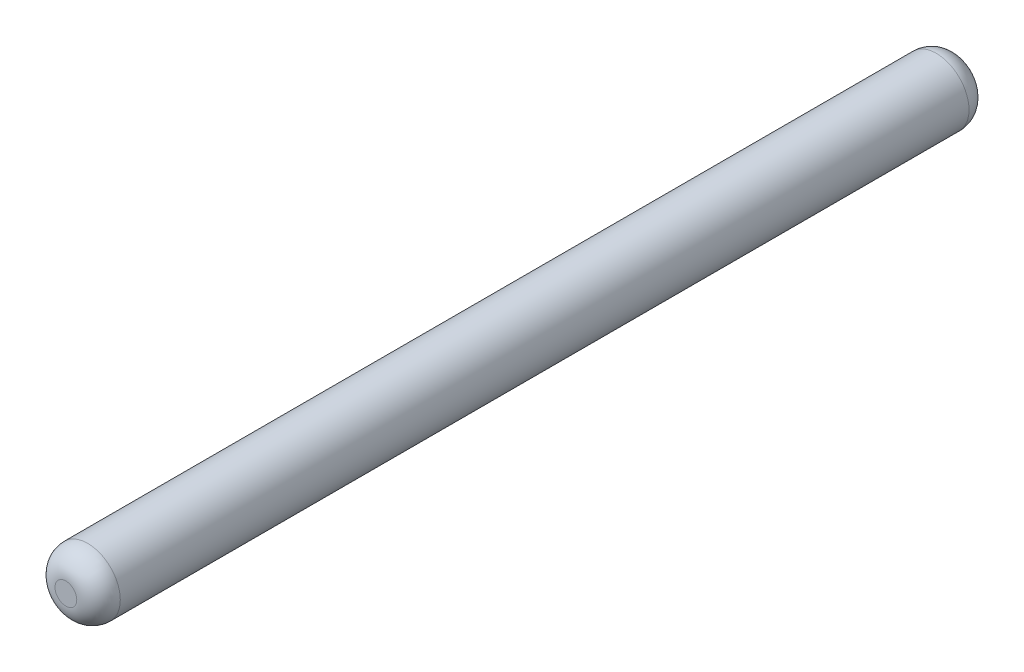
ISO-10303-21;
HEADER;
FILE_DESCRIPTION(('STEP AP214'),'2;1');
FILE_NAME('part.step','',(''),(''),'','','');
FILE_SCHEMA(('AUTOMOTIVE_DESIGN { 1 0 10303 214 1 1 1 1 }'));
ENDSEC;
DATA;
#1=APPLICATION_CONTEXT('core data for automotive mechanical design processes');
#2=APPLICATION_PROTOCOL_DEFINITION('international standard','automotive_design',2000,#1);
#3=PRODUCT_CONTEXT('',#1,'mechanical');
#4=PRODUCT('Part','Part','',(#3));
#5=PRODUCT_RELATED_PRODUCT_CATEGORY('part','',(#4));
#6=PRODUCT_DEFINITION_FORMATION('','',#4);
#7=PRODUCT_DEFINITION_CONTEXT('part definition',#1,'design');
#8=PRODUCT_DEFINITION('design','',#6,#7);
#9=PRODUCT_DEFINITION_SHAPE('','',#8);
#10=(LENGTH_UNIT() NAMED_UNIT(*) SI_UNIT(.MILLI.,.METRE.));
#11=(NAMED_UNIT(*) PLANE_ANGLE_UNIT() SI_UNIT($,.RADIAN.));
#12=(NAMED_UNIT(*) SI_UNIT($,.STERADIAN.) SOLID_ANGLE_UNIT());
#13=UNCERTAINTY_MEASURE_WITH_UNIT(LENGTH_MEASURE(1.E-05),#10,'distance_accuracy_value','');
#14=(GEOMETRIC_REPRESENTATION_CONTEXT(3) GLOBAL_UNCERTAINTY_ASSIGNED_CONTEXT((#13)) GLOBAL_UNIT_ASSIGNED_CONTEXT((#10,
#11,#12)) REPRESENTATION_CONTEXT('',''));
#15=CARTESIAN_POINT('',(0.,0.,0.));
#16=DIRECTION('',(0.,0.,1.));
#17=DIRECTION('',(1.,0.,0.));
#18=AXIS2_PLACEMENT_3D('',#15,#16,#17);
#19=CARTESIAN_POINT('',(0.,0.,82.));
#20=DIRECTION('',(0.,0.,-1.));
#21=DIRECTION('',(-1.,0.,0.));
#22=AXIS2_PLACEMENT_3D('',#19,#20,#21);
#23=PLANE('',#22);
#24=CARTESIAN_POINT('',(1.,0.,82.));
#25=CARTESIAN_POINT('',(0.999981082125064,-0.0183386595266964,81.9999999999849));
#26=CARTESIAN_POINT('',(0.999459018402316,-0.0366766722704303,81.9999999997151));
#27=CARTESIAN_POINT('',(0.997433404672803,-0.0729278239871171,81.9999999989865));
#28=CARTESIAN_POINT('',(0.995949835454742,-0.0908420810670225,81.9999999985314));
#29=CARTESIAN_POINT('',(0.992064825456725,-0.12619835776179,81.9999999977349));
#30=CARTESIAN_POINT('',(0.989682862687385,-0.143642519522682,81.9999999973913));
#31=CARTESIAN_POINT('',(0.984066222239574,-0.17801775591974,81.9999999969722));
#32=CARTESIAN_POINT('',(0.980850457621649,-0.194951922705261,81.9999999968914));
#33=CARTESIAN_POINT('',(0.973631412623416,-0.228272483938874,81.9999999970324));
#34=CARTESIAN_POINT('',(0.96964644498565,-0.244662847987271,81.9999999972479));
#35=CARTESIAN_POINT('',(0.960953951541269,-0.276867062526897,81.9999999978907));
#36=CARTESIAN_POINT('',(0.956264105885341,-0.292685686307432,81.9999999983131));
#37=CARTESIAN_POINT('',(0.946226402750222,-0.3237231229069,81.9999999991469));
#38=CARTESIAN_POINT('',(0.940895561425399,-0.338947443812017,81.9999999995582));
#39=CARTESIAN_POINT('',(0.929638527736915,-0.368778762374,82.0000000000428));
#40=CARTESIAN_POINT('',(0.923728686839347,-0.383391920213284,82.0000000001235));
#41=CARTESIAN_POINT('',(0.913975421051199,-0.405973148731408,81.9999999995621));
#42=CARTESIAN_POINT('',(0.910363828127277,-0.414042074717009,81.9999999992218));
#43=CARTESIAN_POINT('',(0.903376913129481,-0.429112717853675,81.9999999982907));
#44=CARTESIAN_POINT('',(0.900025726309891,-0.436125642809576,81.9999999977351));
#45=CARTESIAN_POINT('',(0.88858060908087,-0.459367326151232,81.9999999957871));
#46=CARTESIAN_POINT('',(0.880120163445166,-0.475417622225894,81.9999999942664));
#47=CARTESIAN_POINT('',(0.862330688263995,-0.507028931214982,81.9999999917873));
#48=CARTESIAN_POINT('',(0.853001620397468,-0.522589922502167,81.9999999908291));
#49=CARTESIAN_POINT('',(0.833502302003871,-0.553176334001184,81.999999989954));
#50=CARTESIAN_POINT('',(0.823332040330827,-0.568201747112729,81.9999999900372));
#51=CARTESIAN_POINT('',(0.802181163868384,-0.597670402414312,81.9999999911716));
#52=CARTESIAN_POINT('',(0.791200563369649,-0.612113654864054,81.9999999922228));
#53=CARTESIAN_POINT('',(0.76846430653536,-0.640375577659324,81.9999999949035));
#54=CARTESIAN_POINT('',(0.756708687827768,-0.654194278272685,81.9999999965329));
#55=CARTESIAN_POINT('',(0.732451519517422,-0.681159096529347,81.9999999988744));
#56=CARTESIAN_POINT('',(0.71995002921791,-0.694305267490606,81.9999999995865));
#57=CARTESIAN_POINT('',(0.694218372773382,-0.719953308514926,82.000000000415));
#58=CARTESIAN_POINT('',(0.680985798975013,-0.732452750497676,82.0000000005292));
#59=CARTESIAN_POINT('',(0.651985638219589,-0.758527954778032,81.9999999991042));
#60=CARTESIAN_POINT('',(0.636126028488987,-0.772002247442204,81.9999999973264));
#61=CARTESIAN_POINT('',(0.612000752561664,-0.791168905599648,81.9999999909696));
#62=CARTESIAN_POINT('',(0.604060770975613,-0.797274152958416,81.9999999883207));
#63=CARTESIAN_POINT('',(0.579285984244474,-0.815702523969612,81.9999999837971));
#64=CARTESIAN_POINT('',(0.56212988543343,-0.827599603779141,81.9999999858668));
#65=CARTESIAN_POINT('',(0.538098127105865,-0.843175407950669,81.9999999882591));
#66=CARTESIAN_POINT('',(0.531523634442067,-0.847328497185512,81.9999999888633));
#67=CARTESIAN_POINT('',(0.515446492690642,-0.857222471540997,81.9999999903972));
#68=CARTESIAN_POINT('',(0.505893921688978,-0.86288289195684,81.9999999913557));
#69=CARTESIAN_POINT('',(0.487352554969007,-0.873457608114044,81.9999999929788));
#70=CARTESIAN_POINT('',(0.47837730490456,-0.878395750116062,81.9999999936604));
#71=CARTESIAN_POINT('',(0.457934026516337,-0.889237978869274,81.999999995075));
#72=CARTESIAN_POINT('',(0.446422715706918,-0.895060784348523,81.9999999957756));
#73=CARTESIAN_POINT('',(0.424700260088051,-0.905526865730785,81.9999999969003));
#74=CARTESIAN_POINT('',(0.41451543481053,-0.91022491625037,81.9999999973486));
#75=CARTESIAN_POINT('',(0.395533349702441,-0.918597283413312,81.9999999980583));
#76=CARTESIAN_POINT('',(0.386757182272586,-0.922319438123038,81.9999999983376));
#77=CARTESIAN_POINT('',(0.370661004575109,-0.928877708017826,81.999999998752));
#78=CARTESIAN_POINT('',(0.363357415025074,-0.931754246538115,81.9999999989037));
#79=CARTESIAN_POINT('',(0.346065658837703,-0.93833021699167,81.9999999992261));
#80=CARTESIAN_POINT('',(0.336049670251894,-0.941956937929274,81.9999999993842));
#81=CARTESIAN_POINT('',(0.323084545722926,-0.946429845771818,81.9999999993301));
#82=CARTESIAN_POINT('',(0.320183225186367,-0.947416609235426,81.9999999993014));
#83=CARTESIAN_POINT('',(0.310475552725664,-0.950672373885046,81.9999999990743));
#84=CARTESIAN_POINT('',(0.303650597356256,-0.952886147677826,81.9999999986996));
#85=CARTESIAN_POINT('',(0.280822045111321,-0.960013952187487,81.9999999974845));
#86=CARTESIAN_POINT('',(0.264712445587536,-0.964593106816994,81.9999999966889));
#87=CARTESIAN_POINT('',(0.232283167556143,-0.972932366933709,81.9999999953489));
#88=CARTESIAN_POINT('',(0.215963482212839,-0.976692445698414,81.9999999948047));
#89=CARTESIAN_POINT('',(0.183153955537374,-0.983380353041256,81.9999999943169));
#90=CARTESIAN_POINT('',(0.166664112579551,-0.98630817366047,81.9999999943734));
#91=CARTESIAN_POINT('',(0.13355762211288,-0.991324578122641,81.999999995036));
#92=CARTESIAN_POINT('',(0.116940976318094,-0.993413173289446,81.9999999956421));
#93=CARTESIAN_POINT('',(0.0836237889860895,-0.996746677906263,81.9999999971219));
#94=CARTESIAN_POINT('',(0.0669232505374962,-0.99799161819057,81.9999999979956));
#95=CARTESIAN_POINT('',(0.0334815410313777,-0.999630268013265,81.9999999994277));
#96=CARTESIAN_POINT('',(0.0167403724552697,-1.00002402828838,81.9999999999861));
#97=CARTESIAN_POINT('',(-0.0167205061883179,-0.999976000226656,82.0000000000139));
#98=CARTESIAN_POINT('',(-0.0334402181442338,-0.999535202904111,81.9999999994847));
#99=CARTESIAN_POINT('',(-0.0668376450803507,-0.997837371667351,81.9999999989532));
#100=CARTESIAN_POINT('',(-0.0835153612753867,-0.996580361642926,81.9999999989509));
#101=CARTESIAN_POINT('',(-0.116789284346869,-0.993249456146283,81.9999999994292));
#102=CARTESIAN_POINT('',(-0.133385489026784,-0.991175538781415,81.9999999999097));
#103=CARTESIAN_POINT('',(-0.166458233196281,-0.986213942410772,82.0000000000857));
#104=CARTESIAN_POINT('',(-0.182934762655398,-0.983326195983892,81.9999999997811));
#105=CARTESIAN_POINT('',(-0.204014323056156,-0.979101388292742,81.9999999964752));
#106=CARTESIAN_POINT('',(-0.208692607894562,-0.978129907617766,81.9999999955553));
#107=CARTESIAN_POINT('',(-0.225051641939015,-0.974603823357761,81.9999999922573));
#108=CARTESIAN_POINT('',(-0.236692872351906,-0.971863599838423,81.9999999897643));
#109=CARTESIAN_POINT('',(-0.264496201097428,-0.964752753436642,81.9999999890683));
#110=CARTESIAN_POINT('',(-0.28060449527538,-0.960168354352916,81.9999999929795));
#111=CARTESIAN_POINT('',(-0.303410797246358,-0.952978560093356,81.999999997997));
#112=CARTESIAN_POINT('',(-0.310226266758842,-0.95073924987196,81.9999999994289));
#113=CARTESIAN_POINT('',(-0.321946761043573,-0.94677453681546,82.0000000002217));
#114=CARTESIAN_POINT('',(-0.32686137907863,-0.945077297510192,82.0000000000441));
#115=CARTESIAN_POINT('',(-0.348352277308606,-0.93748647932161,81.9999999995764));
#116=CARTESIAN_POINT('',(-0.364804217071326,-0.931232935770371,82.0000000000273));
#117=CARTESIAN_POINT('',(-0.39487161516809,-0.918887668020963,81.99999999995));
#118=CARTESIAN_POINT('',(-0.408536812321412,-0.912916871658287,81.9999999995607));
#119=CARTESIAN_POINT('',(-0.42911270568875,-0.903376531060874,81.9999999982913));
#120=CARTESIAN_POINT('',(-0.436125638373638,-0.900025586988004,81.9999999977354));
#121=CARTESIAN_POINT('',(-0.459367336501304,-0.888580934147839,81.9999999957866));
#122=CARTESIAN_POINT('',(-0.475417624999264,-0.880120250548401,81.9999999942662));
#123=CARTESIAN_POINT('',(-0.507028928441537,-0.862330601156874,81.9999999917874));
#124=CARTESIAN_POINT('',(-0.522589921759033,-0.853001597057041,81.9999999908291));
#125=CARTESIAN_POINT('',(-0.55317633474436,-0.83350232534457,81.999999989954));
#126=CARTESIAN_POINT('',(-0.56820174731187,-0.823332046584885,81.9999999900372));
#127=CARTESIAN_POINT('',(-0.597670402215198,-0.802181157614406,81.9999999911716));
#128=CARTESIAN_POINT('',(-0.612113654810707,-0.791200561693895,81.9999999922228));
#129=CARTESIAN_POINT('',(-0.640375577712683,-0.768464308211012,81.9999999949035));
#130=CARTESIAN_POINT('',(-0.65419427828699,-0.756708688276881,81.9999999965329));
#131=CARTESIAN_POINT('',(-0.681159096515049,-0.732451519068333,81.9999999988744));
#132=CARTESIAN_POINT('',(-0.694305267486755,-0.719950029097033,81.9999999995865));
#133=CARTESIAN_POINT('',(-0.719953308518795,-0.69421837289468,82.000000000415));
#134=CARTESIAN_POINT('',(-0.732452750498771,-0.680985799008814,82.0000000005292));
#135=CARTESIAN_POINT('',(-0.758527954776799,-0.651985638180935,81.9999999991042));
#136=CARTESIAN_POINT('',(-0.772002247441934,-0.636126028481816,81.9999999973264));
#137=CARTESIAN_POINT('',(-0.791168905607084,-0.612000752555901,81.9999999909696));
#138=CARTESIAN_POINT('',(-0.797274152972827,-0.604060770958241,81.9999999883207));
#139=CARTESIAN_POINT('',(-0.81570252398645,-0.579285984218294,81.9999999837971));
#140=CARTESIAN_POINT('',(-0.827599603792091,-0.562129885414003,81.9999999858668));
#141=CARTESIAN_POINT('',(-0.843175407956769,-0.538098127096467,81.9999999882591));
#142=CARTESIAN_POINT('',(-0.847328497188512,-0.53152363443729,81.9999999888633));
#143=CARTESIAN_POINT('',(-0.857222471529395,-0.515446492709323,81.9999999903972));
#144=CARTESIAN_POINT('',(-0.862882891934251,-0.505893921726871,81.9999999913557));
#145=CARTESIAN_POINT('',(-0.87345760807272,-0.487352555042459,81.9999999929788));
#146=CARTESIAN_POINT('',(-0.878395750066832,-0.478377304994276,81.9999999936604));
#147=CARTESIAN_POINT('',(-0.88923797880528,-0.457934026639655,81.999999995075));
#148=CARTESIAN_POINT('',(-0.895060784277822,-0.446422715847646,81.9999999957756));
#149=CARTESIAN_POINT('',(-0.905526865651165,-0.424700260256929,81.9999999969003));
#150=CARTESIAN_POINT('',(-0.910224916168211,-0.414515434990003,81.9999999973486));
#151=CARTESIAN_POINT('',(-0.918597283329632,-0.39553334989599,81.9999999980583));
#152=CARTESIAN_POINT('',(-0.922319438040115,-0.386757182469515,81.9999999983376));
#153=CARTESIAN_POINT('',(-0.928877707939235,-0.370661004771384,81.999999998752));
#154=CARTESIAN_POINT('',(-0.93175424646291,-0.363357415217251,81.9999999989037));
#155=CARTESIAN_POINT('',(-0.938330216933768,-0.346065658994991,81.9999999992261));
#156=CARTESIAN_POINT('',(-0.94195693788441,-0.336049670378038,81.9999999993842));
#157=CARTESIAN_POINT('',(-0.946429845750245,-0.323084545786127,81.9999999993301));
#158=CARTESIAN_POINT('',(-0.947416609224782,-0.320183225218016,81.9999999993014));
#159=CARTESIAN_POINT('',(-0.950672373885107,-0.310475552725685,81.9999999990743));
#160=CARTESIAN_POINT('',(-0.952886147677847,-0.303650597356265,81.9999999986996));
#161=CARTESIAN_POINT('',(-0.960013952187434,-0.280822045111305,81.9999999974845));
#162=CARTESIAN_POINT('',(-0.964593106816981,-0.264712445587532,81.9999999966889));
#163=CARTESIAN_POINT('',(-0.972932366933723,-0.232283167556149,81.9999999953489));
#164=CARTESIAN_POINT('',(-0.976692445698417,-0.215963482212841,81.9999999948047));
#165=CARTESIAN_POINT('',(-0.983380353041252,-0.183153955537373,81.9999999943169));
#166=CARTESIAN_POINT('',(-0.986308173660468,-0.166664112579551,81.9999999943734));
#167=CARTESIAN_POINT('',(-0.991324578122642,-0.133557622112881,81.999999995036));
#168=CARTESIAN_POINT('',(-0.993413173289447,-0.116940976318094,81.9999999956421));
#169=CARTESIAN_POINT('',(-0.996746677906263,-0.0836237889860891,81.9999999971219));
#170=CARTESIAN_POINT('',(-0.99799161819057,-0.0669232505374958,81.9999999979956));
#171=CARTESIAN_POINT('',(-0.999630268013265,-0.0334815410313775,81.9999999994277));
#172=CARTESIAN_POINT('',(-1.00002402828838,-0.0167403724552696,81.9999999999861));
#173=CARTESIAN_POINT('',(-0.999976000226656,0.016720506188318,82.0000000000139));
#174=CARTESIAN_POINT('',(-0.99953520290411,0.0334402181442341,81.9999999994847));
#175=CARTESIAN_POINT('',(-0.99783737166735,0.0668376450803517,81.9999999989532));
#176=CARTESIAN_POINT('',(-0.996580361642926,0.0835153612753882,81.9999999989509));
#177=CARTESIAN_POINT('',(-0.993249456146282,0.116789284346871,81.9999999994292));
#178=CARTESIAN_POINT('',(-0.991175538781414,0.133385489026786,81.9999999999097));
#179=CARTESIAN_POINT('',(-0.986213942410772,0.166458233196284,82.0000000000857));
#180=CARTESIAN_POINT('',(-0.983326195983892,0.182934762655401,81.9999999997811));
#181=CARTESIAN_POINT('',(-0.979101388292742,0.20401432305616,81.9999999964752));
#182=CARTESIAN_POINT('',(-0.978129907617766,0.208692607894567,81.9999999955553));
#183=CARTESIAN_POINT('',(-0.97460382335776,0.225051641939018,81.9999999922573));
#184=CARTESIAN_POINT('',(-0.97186359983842,0.236692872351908,81.9999999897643));
#185=CARTESIAN_POINT('',(-0.964752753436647,0.264496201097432,81.9999999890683));
#186=CARTESIAN_POINT('',(-0.960168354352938,0.280604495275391,81.9999999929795));
#187=CARTESIAN_POINT('',(-0.952978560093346,0.303410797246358,81.999999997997));
#188=CARTESIAN_POINT('',(-0.950739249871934,0.310226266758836,81.9999999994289));
#189=CARTESIAN_POINT('',(-0.946774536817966,0.321946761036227,82.0000000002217));
#190=CARTESIAN_POINT('',(-0.945077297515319,0.326861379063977,82.0000000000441));
#191=CARTESIAN_POINT('',(-0.9374864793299,0.348352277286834,81.9999999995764));
#192=CARTESIAN_POINT('',(-0.931232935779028,0.364804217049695,82.0000000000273));
#193=CARTESIAN_POINT('',(-0.918887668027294,0.394871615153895,81.99999999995));
#194=CARTESIAN_POINT('',(-0.912916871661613,0.408536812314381,81.9999999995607));
#195=CARTESIAN_POINT('',(-0.90337653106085,0.42911270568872,81.9999999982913));
#196=CARTESIAN_POINT('',(-0.900025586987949,0.436125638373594,81.9999999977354));
#197=CARTESIAN_POINT('',(-0.888580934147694,0.459367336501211,81.9999999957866));
#198=CARTESIAN_POINT('',(-0.880120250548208,0.475417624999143,81.9999999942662));
#199=CARTESIAN_POINT('',(-0.862330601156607,0.507028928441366,81.9999999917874));
#200=CARTESIAN_POINT('',(-0.853001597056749,0.52258992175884,81.9999999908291));
#201=CARTESIAN_POINT('',(-0.833502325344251,0.553176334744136,81.999999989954));
#202=CARTESIAN_POINT('',(-0.823332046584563,0.568201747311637,81.9999999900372));
#203=CARTESIAN_POINT('',(-0.802181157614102,0.597670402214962,81.9999999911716));
#204=CARTESIAN_POINT('',(-0.791200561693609,0.612113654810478,81.9999999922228));
#205=CARTESIAN_POINT('',(-0.768464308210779,0.640375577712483,81.9999999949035));
#206=CARTESIAN_POINT('',(-0.756708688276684,0.654194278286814,81.9999999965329));
#207=CARTESIAN_POINT('',(-0.732451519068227,0.681159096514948,81.9999999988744));
#208=CARTESIAN_POINT('',(-0.719950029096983,0.694305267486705,81.9999999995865));
#209=CARTESIAN_POINT('',(-0.69421837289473,0.719953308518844,82.000000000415));
#210=CARTESIAN_POINT('',(-0.680985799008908,0.732452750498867,82.0000000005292));
#211=CARTESIAN_POINT('',(-0.65198563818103,0.75852795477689,81.9999999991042));
#212=CARTESIAN_POINT('',(-0.636126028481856,0.772002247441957,81.9999999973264));
#213=CARTESIAN_POINT('',(-0.612000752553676,0.791168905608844,81.9999999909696));
#214=CARTESIAN_POINT('',(-0.604060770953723,0.79727415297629,81.9999999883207));
#215=CARTESIAN_POINT('',(-0.579285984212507,0.815702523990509,81.9999999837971));
#216=CARTESIAN_POINT('',(-0.562129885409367,0.827599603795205,81.9999999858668));
#217=CARTESIAN_POINT('',(-0.538098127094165,0.843175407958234,81.9999999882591));
#218=CARTESIAN_POINT('',(-0.531523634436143,0.847328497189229,81.9999999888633));
#219=CARTESIAN_POINT('',(-0.515446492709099,0.857222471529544,81.9999999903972));
#220=CARTESIAN_POINT('',(-0.505893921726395,0.862882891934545,81.9999999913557));
#221=CARTESIAN_POINT('',(-0.487352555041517,0.873457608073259,81.9999999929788));
#222=CARTESIAN_POINT('',(-0.47837730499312,0.878395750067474,81.9999999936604));
#223=CARTESIAN_POINT('',(-0.457934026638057,0.889237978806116,81.999999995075));
#224=CARTESIAN_POINT('',(-0.446422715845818,0.895060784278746,81.9999999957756));
#225=CARTESIAN_POINT('',(-0.424700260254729,0.905526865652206,81.9999999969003));
#226=CARTESIAN_POINT('',(-0.414515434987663,0.910224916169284,81.9999999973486));
#227=CARTESIAN_POINT('',(-0.395533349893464,0.918597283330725,81.9999999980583));
#228=CARTESIAN_POINT('',(-0.386757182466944,0.922319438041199,81.9999999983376));
#229=CARTESIAN_POINT('',(-0.370661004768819,0.928877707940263,81.999999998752));
#230=CARTESIAN_POINT('',(-0.363357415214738,0.931754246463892,81.9999999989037));
#231=CARTESIAN_POINT('',(-0.346065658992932,0.938330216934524,81.9999999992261));
#232=CARTESIAN_POINT('',(-0.336049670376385,0.941956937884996,81.9999999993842));
#233=CARTESIAN_POINT('',(-0.323084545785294,0.946429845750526,81.9999999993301));
#234=CARTESIAN_POINT('',(-0.320183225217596,0.947416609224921,81.9999999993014));
#235=CARTESIAN_POINT('',(-0.310475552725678,0.950672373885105,81.9999999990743));
#236=CARTESIAN_POINT('',(-0.303650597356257,0.952886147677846,81.9999999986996));
#237=CARTESIAN_POINT('',(-0.280822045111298,0.960013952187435,81.9999999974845));
#238=CARTESIAN_POINT('',(-0.264712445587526,0.964593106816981,81.9999999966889));
#239=CARTESIAN_POINT('',(-0.232283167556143,0.972932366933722,81.9999999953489));
#240=CARTESIAN_POINT('',(-0.215963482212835,0.976692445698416,81.9999999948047));
#241=CARTESIAN_POINT('',(-0.183153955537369,0.983380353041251,81.9999999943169));
#242=CARTESIAN_POINT('',(-0.166664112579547,0.986308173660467,81.9999999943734));
#243=CARTESIAN_POINT('',(-0.133557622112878,0.99132457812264,81.999999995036));
#244=CARTESIAN_POINT('',(-0.116940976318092,0.993413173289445,81.9999999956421));
#245=CARTESIAN_POINT('',(-0.0836237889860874,0.996746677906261,81.9999999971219));
#246=CARTESIAN_POINT('',(-0.0669232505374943,0.997991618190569,81.9999999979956));
#247=CARTESIAN_POINT('',(-0.0334815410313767,0.999630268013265,81.9999999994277));
#248=CARTESIAN_POINT('',(-0.0167403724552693,1.00002402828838,81.9999999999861));
#249=CARTESIAN_POINT('',(0.0167205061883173,0.999976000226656,82.0000000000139));
#250=CARTESIAN_POINT('',(0.033440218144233,0.999535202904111,81.9999999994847));
#251=CARTESIAN_POINT('',(0.0668376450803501,0.997837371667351,81.9999999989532));
#252=CARTESIAN_POINT('',(0.0835153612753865,0.996580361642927,81.9999999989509));
#253=CARTESIAN_POINT('',(0.116789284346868,0.993249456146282,81.9999999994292));
#254=CARTESIAN_POINT('',(0.133385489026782,0.991175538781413,81.9999999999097));
#255=CARTESIAN_POINT('',(0.166458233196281,0.986213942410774,82.0000000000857));
#256=CARTESIAN_POINT('',(0.182934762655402,0.9833261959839,81.9999999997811));
#257=CARTESIAN_POINT('',(0.204014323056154,0.97910138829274,81.9999999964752));
#258=CARTESIAN_POINT('',(0.208692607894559,0.978129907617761,81.9999999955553));
#259=CARTESIAN_POINT('',(0.225051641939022,0.974603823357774,81.9999999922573));
#260=CARTESIAN_POINT('',(0.236692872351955,0.971863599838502,81.9999999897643));
#261=CARTESIAN_POINT('',(0.264496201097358,0.964752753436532,81.9999999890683));
#262=CARTESIAN_POINT('',(0.280604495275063,0.960168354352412,81.9999999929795));
#263=CARTESIAN_POINT('',(0.303410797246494,0.952978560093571,81.999999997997));
#264=CARTESIAN_POINT('',(0.310226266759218,0.950739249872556,81.9999999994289));
#265=CARTESIAN_POINT('',(0.321946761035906,0.946774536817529,82.0000000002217));
#266=CARTESIAN_POINT('',(0.326861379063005,0.945077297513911,82.0000000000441));
#267=CARTESIAN_POINT('',(0.348352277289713,0.93748647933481,81.9999999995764));
#268=CARTESIAN_POINT('',(0.364804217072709,0.93123293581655,82.0000000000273));
#269=CARTESIAN_POINT('',(0.394871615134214,0.918887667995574,81.99999999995));
#270=CARTESIAN_POINT('',(0.408536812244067,0.912916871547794,81.9999999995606));
#271=CARTESIAN_POINT('',(0.429112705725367,0.903376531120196,81.9999999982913));
#272=CARTESIAN_POINT('',(0.436125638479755,0.900025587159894,81.9999999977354));
#273=CARTESIAN_POINT('',(0.459367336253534,0.888580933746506,81.9999999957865));
#274=CARTESIAN_POINT('',(0.475417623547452,0.880120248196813,81.9999999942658));
#275=CARTESIAN_POINT('',(0.507028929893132,0.862330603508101,81.9999999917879));
#276=CARTESIAN_POINT('',(0.522589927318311,0.853001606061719,81.9999999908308));
#277=CARTESIAN_POINT('',(0.5531763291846,0.833502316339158,81.9999999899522));
#278=CARTESIAN_POINT('',(0.568201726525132,0.823332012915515,81.9999999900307));
#279=CARTESIAN_POINT('',(0.597670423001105,0.802181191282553,81.9999999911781));
#280=CARTESIAN_POINT('',(0.612113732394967,0.791200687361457,81.9999999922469));
#281=CARTESIAN_POINT('',(0.64037550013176,0.768464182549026,81.9999999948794));
#282=CARTESIAN_POINT('',(0.654193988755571,0.756708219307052,81.999999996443));
#283=CARTESIAN_POINT('',(0.681159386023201,0.73245198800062,81.9999999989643));
#284=CARTESIAN_POINT('',(0.694306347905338,0.71995177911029,81.9999999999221));
#285=CARTESIAN_POINT('',(0.719903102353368,0.694265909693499,82.0000000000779));
#286=CARTESIAN_POINT('',(0.732353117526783,0.681080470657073,81.9999999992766));
#287=CARTESIAN_POINT('',(0.756547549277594,0.654077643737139,81.9999999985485));
#288=CARTESIAN_POINT('',(0.768291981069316,0.640260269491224,81.9999999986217));
#289=CARTESIAN_POINT('',(0.791026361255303,0.612017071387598,82.000000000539));
#290=CARTESIAN_POINT('',(0.802016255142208,0.59759120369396,82.0000000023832));
#291=CARTESIAN_POINT('',(0.820604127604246,0.571877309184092,81.9999999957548));
#292=CARTESIAN_POINT('',(0.828363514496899,0.560705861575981,81.9999999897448));
#293=CARTESIAN_POINT('',(0.844903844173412,0.535641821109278,81.9999999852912));
#294=CARTESIAN_POINT('',(0.853560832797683,0.521667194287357,81.9999999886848));
#295=CARTESIAN_POINT('',(0.870701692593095,0.492437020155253,81.9999999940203));
#296=CARTESIAN_POINT('',(0.87914160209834,0.477155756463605,81.9999999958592));
#297=CARTESIAN_POINT('',(0.891301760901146,0.453698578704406,81.9999999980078));
#298=CARTESIAN_POINT('',(0.895322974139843,0.445677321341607,81.9999999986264));
#299=CARTESIAN_POINT('',(0.907417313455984,0.420726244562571,81.9999999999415));
#300=CARTESIAN_POINT('',(0.915128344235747,0.403618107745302,81.9999999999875));
#301=CARTESIAN_POINT('',(0.924898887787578,0.380266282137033,82.000000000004));
#302=CARTESIAN_POINT('',(0.927372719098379,0.37419216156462,82.0000000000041));
#303=CARTESIAN_POINT('',(0.933873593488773,0.35778254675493,81.999999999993));
#304=CARTESIAN_POINT('',(0.937792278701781,0.347403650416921,81.9999999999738));
#305=CARTESIAN_POINT('',(0.945147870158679,0.326885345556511,81.9999999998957));
#306=CARTESIAN_POINT('',(0.948596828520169,0.316750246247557,81.9999999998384));
#307=CARTESIAN_POINT('',(0.955048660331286,0.296743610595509,81.9999999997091));
#308=CARTESIAN_POINT('',(0.958063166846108,0.286875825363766,81.9999999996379));
#309=CARTESIAN_POINT('',(0.963677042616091,0.2674239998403,81.9999999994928));
#310=CARTESIAN_POINT('',(0.966287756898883,0.257843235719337,81.9999999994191));
#311=CARTESIAN_POINT('',(0.971125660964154,0.23898403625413,81.9999999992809));
#312=CARTESIAN_POINT('',(0.973363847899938,0.22970840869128,81.9999999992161));
#313=CARTESIAN_POINT('',(0.979421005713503,0.202925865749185,81.9999999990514));
#314=CARTESIAN_POINT('',(0.982902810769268,0.185341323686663,81.9999999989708));
#315=CARTESIAN_POINT('',(0.988652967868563,0.151540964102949,81.9999999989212));
#316=CARTESIAN_POINT('',(0.991000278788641,0.135338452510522,81.9999999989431));
#317=CARTESIAN_POINT('',(0.994708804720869,0.104377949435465,81.9999999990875));
#318=CARTESIAN_POINT('',(0.996142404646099,0.0896286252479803,81.9999999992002));
#319=CARTESIAN_POINT('',(0.998233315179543,0.0616282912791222,81.9999999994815));
#320=CARTESIAN_POINT('',(0.998956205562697,0.0483821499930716,81.9999999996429));
#321=CARTESIAN_POINT('',(0.999816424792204,0.023422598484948,81.9999999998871));
#322=CARTESIAN_POINT('',(1.00001236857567,0.0117111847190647,81.9999999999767));
#323=CARTESIAN_POINT('',(1.,0.,82.));
#324=B_SPLINE_CURVE_WITH_KNOTS('',3,(#24,#25,#26,#27,#28,#29,#30,#31,#32,#33,#34,#35,#36,#37,
#38,#39,#40,#41,#42,#43,#44,#45,#46,#47,#48,#49,#50,#51,#52,#53,#54,#55,#56,#57,#58,#59,#60,#61,
#62,#63,#64,#65,#66,#67,#68,#69,#70,#71,#72,#73,#74,#75,#76,#77,#78,#79,#80,#81,#82,#83,#84,#85,
#86,#87,#88,#89,#90,#91,#92,#93,#94,#95,#96,#97,#98,#99,#100,#101,#102,#103,#104,#105,#106,#107,
#108,#109,#110,#111,#112,#113,#114,#115,#116,#117,#118,#119,#120,#121,#122,#123,#124,#125,#126,
#127,#128,#129,#130,#131,#132,#133,#134,#135,#136,#137,#138,#139,#140,#141,#142,#143,#144,#145,
#146,#147,#148,#149,#150,#151,#152,#153,#154,#155,#156,#157,#158,#159,#160,#161,#162,#163,#164,
#165,#166,#167,#168,#169,#170,#171,#172,#173,#174,#175,#176,#177,#178,#179,#180,#181,#182,#183,
#184,#185,#186,#187,#188,#189,#190,#191,#192,#193,#194,#195,#196,#197,#198,#199,#200,#201,#202,
#203,#204,#205,#206,#207,#208,#209,#210,#211,#212,#213,#214,#215,#216,#217,#218,#219,#220,#221,
#222,#223,#224,#225,#226,#227,#228,#229,#230,#231,#232,#233,#234,#235,#236,#237,#238,#239,#240,
#241,#242,#243,#244,#245,#246,#247,#248,#249,#250,#251,#252,#253,#254,#255,#256,#257,#258,#259,
#260,#261,#262,#263,#264,#265,#266,#267,#268,#269,#270,#271,#272,#273,#274,#275,#276,#277,#278,
#279,#280,#281,#282,#283,#284,#285,#286,#287,#288,#289,#290,#291,#292,#293,#294,#295,#296,#297,
#298,#299,#300,#301,#302,#303,#304,#305,#306,#307,#308,#309,#310,#311,#312,#313,#314,#315,#316,
#317,#318,#319,#320,#321,#322,#323),.UNSPECIFIED.,.F.,.F.,(4,2,2,2,2,2,2,2,2,2,2,2,2,2,2,2,2,2,
2,2,2,2,2,2,2,2,2,2,2,2,2,2,2,2,2,2,2,2,2,2,2,2,2,2,2,2,2,2,2,2,2,2,2,2,2,2,2,2,2,2,2,2,2,2,2,2,
2,2,2,2,2,2,2,2,2,2,2,2,2,2,2,2,2,2,2,2,2,2,2,2,2,2,2,2,2,2,2,2,2,2,2,2,2,2,2,2,2,2,2,2,2,2,2,2,
2,2,2,2,2,2,2,2,2,2,2,2,2,2,2,2,2,2,2,2,2,2,2,2,2,2,2,2,2,2,2,2,2,2,2,4),(0.,0.0550088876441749,
0.108909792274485,0.161703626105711,0.213391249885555,0.26397347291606,0.313451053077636,
0.361824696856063,0.409095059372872,0.435613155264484,0.458928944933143,0.513329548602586,
0.567732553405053,0.62213627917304,0.676539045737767,0.730939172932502,0.785334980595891,
0.839922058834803,0.902310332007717,0.932354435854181,0.99493298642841,1.01826118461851,
1.05156509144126,1.08229292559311,1.12098323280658,1.1546255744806,1.18322018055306,
1.20676722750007,1.23871812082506,1.24791168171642,1.26943535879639,1.31965472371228,
1.36987572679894,1.42009721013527,1.47031801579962,1.52053698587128,1.57075296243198,
1.62090934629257,1.67106426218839,1.72122052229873,1.77138093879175,1.78571496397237,
1.8215847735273,1.87179917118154,1.89331966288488,1.90891781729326,1.96169365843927,
2.00641600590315,2.02973179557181,2.08413239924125,2.13853540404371,2.19293912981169,
2.24734189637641,2.30174202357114,2.35613783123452,2.41072490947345,2.47311318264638,
2.503157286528,2.56573583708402,2.58906403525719,2.62236794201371,2.65309577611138,
2.69178608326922,2.72542842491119,2.75402303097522,2.77757007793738,2.80952097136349,
2.81871453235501,2.84023820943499,2.89045757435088,2.94067857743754,2.99090006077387,
3.04112086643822,3.09133983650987,3.14155581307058,3.19171219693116,3.24186711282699,
3.29202337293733,3.34218378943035,3.35651781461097,3.3923876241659,3.44260202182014,
3.46412251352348,3.47972066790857,3.53249650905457,3.57721885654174,3.6005346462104,
3.65493524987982,3.70933825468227,3.76374198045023,3.81814474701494,3.87254487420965,
3.92694068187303,3.98152776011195,4.04391603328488,4.07396013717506,4.13653868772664,
4.15986688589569,4.19317079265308,4.22389862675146,4.26258893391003,4.29623127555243,
4.32482588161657,4.34837292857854,4.38032382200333,4.38951738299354,4.41104106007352,
4.46126042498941,4.51148142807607,4.56170291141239,4.61192371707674,4.6621426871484,
4.7123586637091,4.76251504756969,4.81266996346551,4.86282622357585,4.91298664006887,
4.92732066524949,4.96319047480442,5.01340487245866,5.034925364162,5.05052351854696,
5.10329935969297,5.14802170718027,5.17133749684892,5.22573810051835,5.28014110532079,
5.33454483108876,5.38894759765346,5.44334772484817,5.49774353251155,5.55212186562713,
5.60649902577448,5.66088010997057,5.70167363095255,5.75096579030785,5.80331212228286,
5.83022838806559,5.88648953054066,5.90616475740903,5.93943999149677,5.97155215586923,
6.00250113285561,6.03228681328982,6.06090909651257,6.11465823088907,6.16375393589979,
6.2081955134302,6.24798242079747,6.28311427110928),.UNSPECIFIED.);
#325=CARTESIAN_POINT('',(1.,0.,82.));
#326=VERTEX_POINT('',#325);
#327=EDGE_CURVE('E38',#326,#326,#324,.T.);
#328=ORIENTED_EDGE('',*,*,#327,.F.);
#329=EDGE_LOOP('',(#328));
#330=FACE_BOUND('',#329,.T.);
#331=ADVANCED_FACE('F17',(#330),#23,.F.);
#332=CARTESIAN_POINT('',(0.,0.,0.));
#333=DIRECTION('',(0.,0.,-1.));
#334=DIRECTION('',(-1.,0.,0.));
#335=AXIS2_PLACEMENT_3D('',#332,#333,#334);
#336=PLANE('',#335);
#337=CARTESIAN_POINT('',(0.,0.,0.));
#338=DIRECTION('',(0.,0.,1.));
#339=DIRECTION('',(1.,0.,0.));
#340=AXIS2_PLACEMENT_3D('',#337,#338,#339);
#341=CIRCLE('',#340,1.);
#342=CARTESIAN_POINT('',(1.,0.,0.));
#343=VERTEX_POINT('',#342);
#344=EDGE_CURVE('E21',#343,#343,#341,.T.);
#345=ORIENTED_EDGE('',*,*,#344,.F.);
#346=EDGE_LOOP('',(#345));
#347=FACE_BOUND('',#346,.T.);
#348=ADVANCED_FACE('F50',(#347),#336,.T.);
#349=CARTESIAN_POINT('',(0.,0.,80.));
#350=DIRECTION('',(0.,0.,1.));
#351=DIRECTION('',(1.,0.,0.));
#352=AXIS2_PLACEMENT_3D('',#349,#350,#351);
#353=DEGENERATE_TOROIDAL_SURFACE('',#352,1.,2.00000000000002,.T.);
#354=CARTESIAN_POINT('',(0.,0.,80.));
#355=DIRECTION('',(0.,0.,1.));
#356=DIRECTION('',(1.,0.,0.));
#357=AXIS2_PLACEMENT_3D('',#354,#355,#356);
#358=CIRCLE('',#357,3.);
#359=CARTESIAN_POINT('',(3.,0.,80.));
#360=VERTEX_POINT('',#359);
#361=EDGE_CURVE('E26',#360,#360,#358,.F.);
#362=ORIENTED_EDGE('',*,*,#361,.F.);
#363=EDGE_LOOP('',(#362));
#364=FACE_BOUND('',#363,.T.);
#365=ORIENTED_EDGE('',*,*,#327,.T.);
#366=EDGE_LOOP('',(#365));
#367=FACE_BOUND('',#366,.T.);
#368=ADVANCED_FACE('F41',(#364,#367),#353,.T.);
#369=CARTESIAN_POINT('',(0.,0.,2.));
#370=DIRECTION('',(0.,0.,1.));
#371=DIRECTION('',(1.,0.,0.));
#372=AXIS2_PLACEMENT_3D('',#369,#370,#371);
#373=DEGENERATE_TOROIDAL_SURFACE('',#372,1.,2.,.T.);
#374=ORIENTED_EDGE('',*,*,#344,.T.);
#375=EDGE_LOOP('',(#374));
#376=FACE_BOUND('',#375,.T.);
#377=CARTESIAN_POINT('',(0.,0.,2.));
#378=DIRECTION('',(0.,0.,1.));
#379=DIRECTION('',(1.,0.,0.));
#380=AXIS2_PLACEMENT_3D('',#377,#378,#379);
#381=CIRCLE('',#380,3.);
#382=CARTESIAN_POINT('',(3.,0.,2.));
#383=VERTEX_POINT('',#382);
#384=EDGE_CURVE('E10',#383,#383,#381,.T.);
#385=ORIENTED_EDGE('',*,*,#384,.F.);
#386=EDGE_LOOP('',(#385));
#387=FACE_BOUND('',#386,.T.);
#388=ADVANCED_FACE('F19',(#376,#387),#373,.T.);
#389=CARTESIAN_POINT('',(0.,0.,0.));
#390=DIRECTION('',(0.,0.,1.));
#391=DIRECTION('',(1.,0.,0.));
#392=AXIS2_PLACEMENT_3D('',#389,#390,#391);
#393=CYLINDRICAL_SURFACE('',#392,3.);
#394=ORIENTED_EDGE('',*,*,#384,.T.);
#395=EDGE_LOOP('',(#394));
#396=FACE_BOUND('',#395,.T.);
#397=ORIENTED_EDGE('',*,*,#361,.T.);
#398=EDGE_LOOP('',(#397));
#399=FACE_BOUND('',#398,.T.);
#400=ADVANCED_FACE('F58',(#396,#399),#393,.T.);
#401=CLOSED_SHELL('',(#331,#348,#368,#388,#400));
#402=MANIFOLD_SOLID_BREP('B1',#401);
#403=ADVANCED_BREP_SHAPE_REPRESENTATION('',(#18,#402),#14);
#404=SHAPE_DEFINITION_REPRESENTATION(#9,#403);
ENDSEC;
END-ISO-10303-21;
